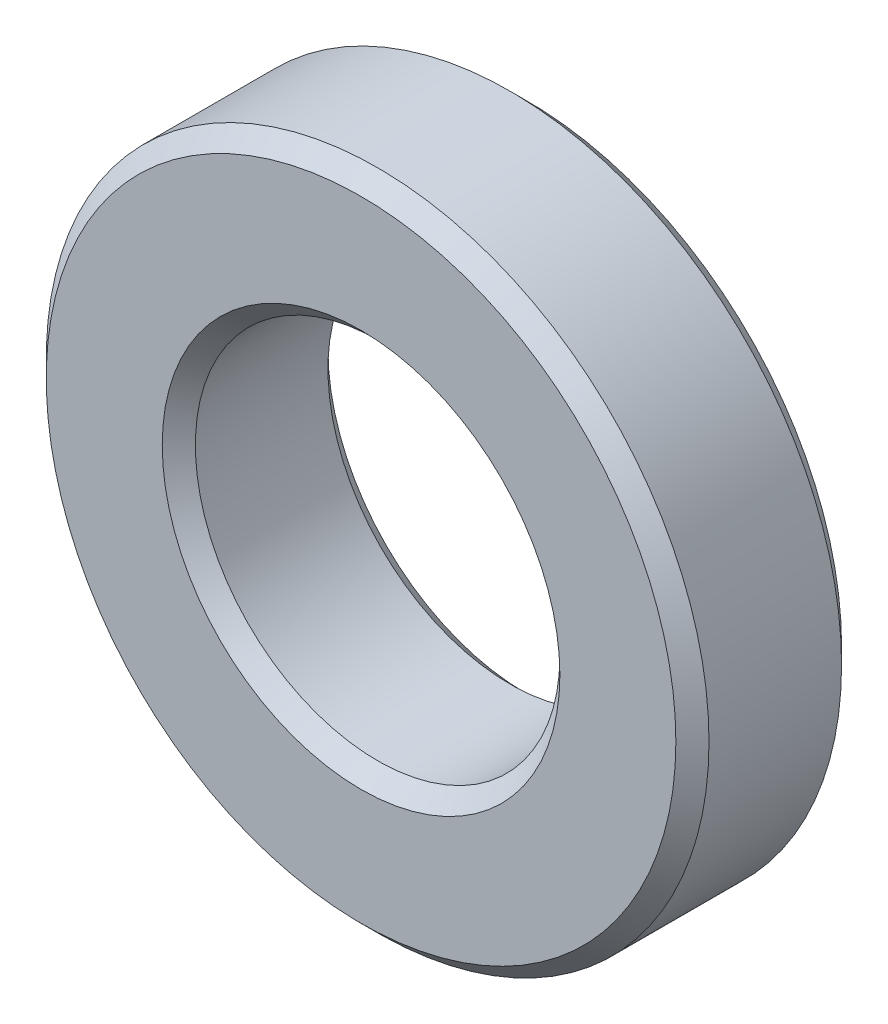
from build123d import *

# Parameters (mm, degrees)
SKETCH1_R           = 2
SKETCH1_R_2         = 1.1
BOSS_EXTRUDE2_DEPTH = 0.5
CHAMFER3_SIZE       = 0.1


with BuildPart() as part:
    # Sketch1 → Boss-Extrude2 (new, symmetric)
    with BuildSketch(Plane.XY):
        Circle(SKETCH1_R)
        Circle(SKETCH1_R_2, mode=Mode.SUBTRACT)
    extrude(amount=BOSS_EXTRUDE2_DEPTH, both=True)

    # Chamfer3
    chamfer3_edges = [part.edges().sort_by_distance(p)[0] for p in [
        (-2, 0, -0.5),
        (-2, 0, 0.5),
        (-1.1, 0, -0.5),
        (-1.1, 0, 0.5),
    ]]
    chamfer(chamfer3_edges, length=CHAMFER3_SIZE)


solid = part.part
